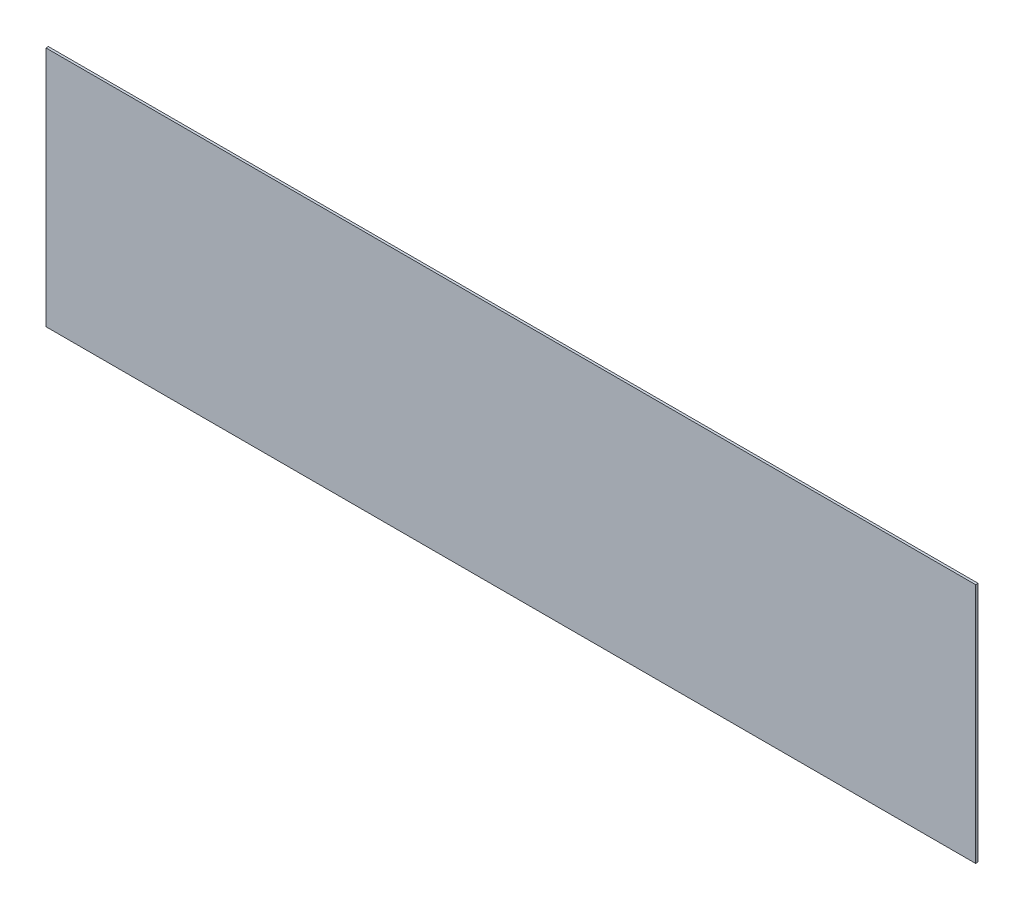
ISO-10303-21;
HEADER;
FILE_DESCRIPTION(('STEP AP214'),'2;1');
FILE_NAME('part.step','',(''),(''),'','','');
FILE_SCHEMA(('AUTOMOTIVE_DESIGN { 1 0 10303 214 1 1 1 1 }'));
ENDSEC;
DATA;
#1=APPLICATION_CONTEXT('core data for automotive mechanical design processes');
#2=APPLICATION_PROTOCOL_DEFINITION('international standard','automotive_design',2000,#1);
#3=PRODUCT_CONTEXT('',#1,'mechanical');
#4=PRODUCT('Part','Part','',(#3));
#5=PRODUCT_RELATED_PRODUCT_CATEGORY('part','',(#4));
#6=PRODUCT_DEFINITION_FORMATION('','',#4);
#7=PRODUCT_DEFINITION_CONTEXT('part definition',#1,'design');
#8=PRODUCT_DEFINITION('design','',#6,#7);
#9=PRODUCT_DEFINITION_SHAPE('','',#8);
#10=(LENGTH_UNIT() NAMED_UNIT(*) SI_UNIT(.MILLI.,.METRE.));
#11=(NAMED_UNIT(*) PLANE_ANGLE_UNIT() SI_UNIT($,.RADIAN.));
#12=(NAMED_UNIT(*) SI_UNIT($,.STERADIAN.) SOLID_ANGLE_UNIT());
#13=UNCERTAINTY_MEASURE_WITH_UNIT(LENGTH_MEASURE(1.E-05),#10,'distance_accuracy_value','');
#14=(GEOMETRIC_REPRESENTATION_CONTEXT(3) GLOBAL_UNCERTAINTY_ASSIGNED_CONTEXT((#13)) GLOBAL_UNIT_ASSIGNED_CONTEXT((#10,
#11,#12)) REPRESENTATION_CONTEXT('',''));
#15=CARTESIAN_POINT('',(0.,0.,0.));
#16=DIRECTION('',(0.,0.,1.));
#17=DIRECTION('',(1.,0.,0.));
#18=AXIS2_PLACEMENT_3D('',#15,#16,#17);
#19=CARTESIAN_POINT('',(385.,-100.,2.));
#20=DIRECTION('',(-1.,0.,0.));
#21=DIRECTION('',(0.,0.,1.));
#22=AXIS2_PLACEMENT_3D('',#19,#20,#21);
#23=PLANE('',#22);
#24=DIRECTION('',(0.,1.,0.));
#25=VECTOR('',#24,1.);
#26=CARTESIAN_POINT('',(385.,-100.,0.));
#27=LINE('',#26,#25);
#28=CARTESIAN_POINT('',(385.,-100.,0.));
#29=VERTEX_POINT('',#28);
#30=CARTESIAN_POINT('',(385.,100.,0.));
#31=VERTEX_POINT('',#30);
#32=EDGE_CURVE('E101',#29,#31,#27,.T.);
#33=ORIENTED_EDGE('',*,*,#32,.T.);
#34=DIRECTION('',(0.,0.,-1.));
#35=VECTOR('',#34,1.);
#36=CARTESIAN_POINT('',(385.,100.,2.));
#37=LINE('',#36,#35);
#38=CARTESIAN_POINT('',(385.,100.,2.));
#39=VERTEX_POINT('',#38);
#40=EDGE_CURVE('E11',#39,#31,#37,.T.);
#41=ORIENTED_EDGE('',*,*,#40,.F.);
#42=DIRECTION('',(0.,1.,0.));
#43=VECTOR('',#42,1.);
#44=CARTESIAN_POINT('',(385.,-100.,2.));
#45=LINE('',#44,#43);
#46=CARTESIAN_POINT('',(385.,-100.,2.));
#47=VERTEX_POINT('',#46);
#48=EDGE_CURVE('E89',#47,#39,#45,.T.);
#49=ORIENTED_EDGE('',*,*,#48,.F.);
#50=DIRECTION('',(0.,0.,-1.));
#51=VECTOR('',#50,1.);
#52=CARTESIAN_POINT('',(385.,-100.,2.));
#53=LINE('',#52,#51);
#54=EDGE_CURVE('E97',#47,#29,#53,.T.);
#55=ORIENTED_EDGE('',*,*,#54,.T.);
#56=EDGE_LOOP('',(#33,#41,#49,#55));
#57=FACE_BOUND('',#56,.T.);
#58=ADVANCED_FACE('F38',(#57),#23,.F.);
#59=CARTESIAN_POINT('',(-385.,100.,2.));
#60=DIRECTION('',(0.,-1.,0.));
#61=DIRECTION('',(0.,0.,-1.));
#62=AXIS2_PLACEMENT_3D('',#59,#60,#61);
#63=PLANE('',#62);
#64=DIRECTION('',(-1.,0.,0.));
#65=VECTOR('',#64,1.);
#66=CARTESIAN_POINT('',(-385.,100.,0.));
#67=LINE('',#66,#65);
#68=CARTESIAN_POINT('',(-385.,100.,0.));
#69=VERTEX_POINT('',#68);
#70=EDGE_CURVE('E93',#31,#69,#67,.T.);
#71=ORIENTED_EDGE('',*,*,#70,.T.);
#72=DIRECTION('',(0.,0.,-1.));
#73=VECTOR('',#72,1.);
#74=CARTESIAN_POINT('',(-385.,100.,2.));
#75=LINE('',#74,#73);
#76=CARTESIAN_POINT('',(-385.,100.,2.));
#77=VERTEX_POINT('',#76);
#78=EDGE_CURVE('E46',#77,#69,#75,.T.);
#79=ORIENTED_EDGE('',*,*,#78,.F.);
#80=DIRECTION('',(-1.,0.,0.));
#81=VECTOR('',#80,1.);
#82=CARTESIAN_POINT('',(-385.,100.,2.));
#83=LINE('',#82,#81);
#84=EDGE_CURVE('E84',#39,#77,#83,.T.);
#85=ORIENTED_EDGE('',*,*,#84,.F.);
#86=ORIENTED_EDGE('',*,*,#40,.T.);
#87=EDGE_LOOP('',(#71,#79,#85,#86));
#88=FACE_BOUND('',#87,.T.);
#89=ADVANCED_FACE('F92',(#88),#63,.F.);
#90=CARTESIAN_POINT('',(-385.,-100.,2.));
#91=DIRECTION('',(1.,0.,0.));
#92=DIRECTION('',(0.,0.,-1.));
#93=AXIS2_PLACEMENT_3D('',#90,#91,#92);
#94=PLANE('',#93);
#95=DIRECTION('',(0.,-1.,0.));
#96=VECTOR('',#95,1.);
#97=CARTESIAN_POINT('',(-385.,-100.,0.));
#98=LINE('',#97,#96);
#99=CARTESIAN_POINT('',(-385.,-100.,0.));
#100=VERTEX_POINT('',#99);
#101=EDGE_CURVE('E71',#69,#100,#98,.T.);
#102=ORIENTED_EDGE('',*,*,#101,.T.);
#103=DIRECTION('',(0.,0.,-1.));
#104=VECTOR('',#103,1.);
#105=CARTESIAN_POINT('',(-385.,-100.,2.));
#106=LINE('',#105,#104);
#107=CARTESIAN_POINT('',(-385.,-100.,2.));
#108=VERTEX_POINT('',#107);
#109=EDGE_CURVE('E94',#108,#100,#106,.T.);
#110=ORIENTED_EDGE('',*,*,#109,.F.);
#111=DIRECTION('',(0.,-1.,0.));
#112=VECTOR('',#111,1.);
#113=CARTESIAN_POINT('',(-385.,-100.,2.));
#114=LINE('',#113,#112);
#115=EDGE_CURVE('E87',#77,#108,#114,.T.);
#116=ORIENTED_EDGE('',*,*,#115,.F.);
#117=ORIENTED_EDGE('',*,*,#78,.T.);
#118=EDGE_LOOP('',(#102,#110,#116,#117));
#119=FACE_BOUND('',#118,.T.);
#120=ADVANCED_FACE('F95',(#119),#94,.F.);
#121=CARTESIAN_POINT('',(-385.,-100.,2.));
#122=DIRECTION('',(0.,1.,0.));
#123=DIRECTION('',(0.,0.,1.));
#124=AXIS2_PLACEMENT_3D('',#121,#122,#123);
#125=PLANE('',#124);
#126=DIRECTION('',(1.,0.,0.));
#127=VECTOR('',#126,1.);
#128=CARTESIAN_POINT('',(-385.,-100.,0.));
#129=LINE('',#128,#127);
#130=EDGE_CURVE('E77',#100,#29,#129,.T.);
#131=ORIENTED_EDGE('',*,*,#130,.T.);
#132=ORIENTED_EDGE('',*,*,#54,.F.);
#133=DIRECTION('',(1.,0.,0.));
#134=VECTOR('',#133,1.);
#135=CARTESIAN_POINT('',(-385.,-100.,2.));
#136=LINE('',#135,#134);
#137=EDGE_CURVE('E54',#108,#47,#136,.T.);
#138=ORIENTED_EDGE('',*,*,#137,.F.);
#139=ORIENTED_EDGE('',*,*,#109,.T.);
#140=EDGE_LOOP('',(#131,#132,#138,#139));
#141=FACE_BOUND('',#140,.T.);
#142=ADVANCED_FACE('F108',(#141),#125,.F.);
#143=CARTESIAN_POINT('',(0.,0.,2.));
#144=DIRECTION('',(0.,0.,-1.));
#145=DIRECTION('',(-1.,0.,0.));
#146=AXIS2_PLACEMENT_3D('',#143,#144,#145);
#147=PLANE('',#146);
#148=ORIENTED_EDGE('',*,*,#48,.T.);
#149=ORIENTED_EDGE('',*,*,#84,.T.);
#150=ORIENTED_EDGE('',*,*,#115,.T.);
#151=ORIENTED_EDGE('',*,*,#137,.T.);
#152=EDGE_LOOP('',(#148,#149,#150,#151));
#153=FACE_BOUND('',#152,.T.);
#154=ADVANCED_FACE('F85',(#153),#147,.F.);
#155=CARTESIAN_POINT('',(0.,0.,0.));
#156=DIRECTION('',(0.,0.,-1.));
#157=DIRECTION('',(-1.,0.,0.));
#158=AXIS2_PLACEMENT_3D('',#155,#156,#157);
#159=PLANE('',#158);
#160=ORIENTED_EDGE('',*,*,#32,.F.);
#161=ORIENTED_EDGE('',*,*,#130,.F.);
#162=ORIENTED_EDGE('',*,*,#101,.F.);
#163=ORIENTED_EDGE('',*,*,#70,.F.);
#164=EDGE_LOOP('',(#160,#161,#162,#163));
#165=FACE_BOUND('',#164,.T.);
#166=ADVANCED_FACE('F111',(#165),#159,.T.);
#167=CLOSED_SHELL('',(#58,#89,#120,#142,#154,#166));
#168=MANIFOLD_SOLID_BREP('B2',#167);
#169=ADVANCED_BREP_SHAPE_REPRESENTATION('',(#18,#168),#14);
#170=SHAPE_DEFINITION_REPRESENTATION(#9,#169);
ENDSEC;
END-ISO-10303-21;
